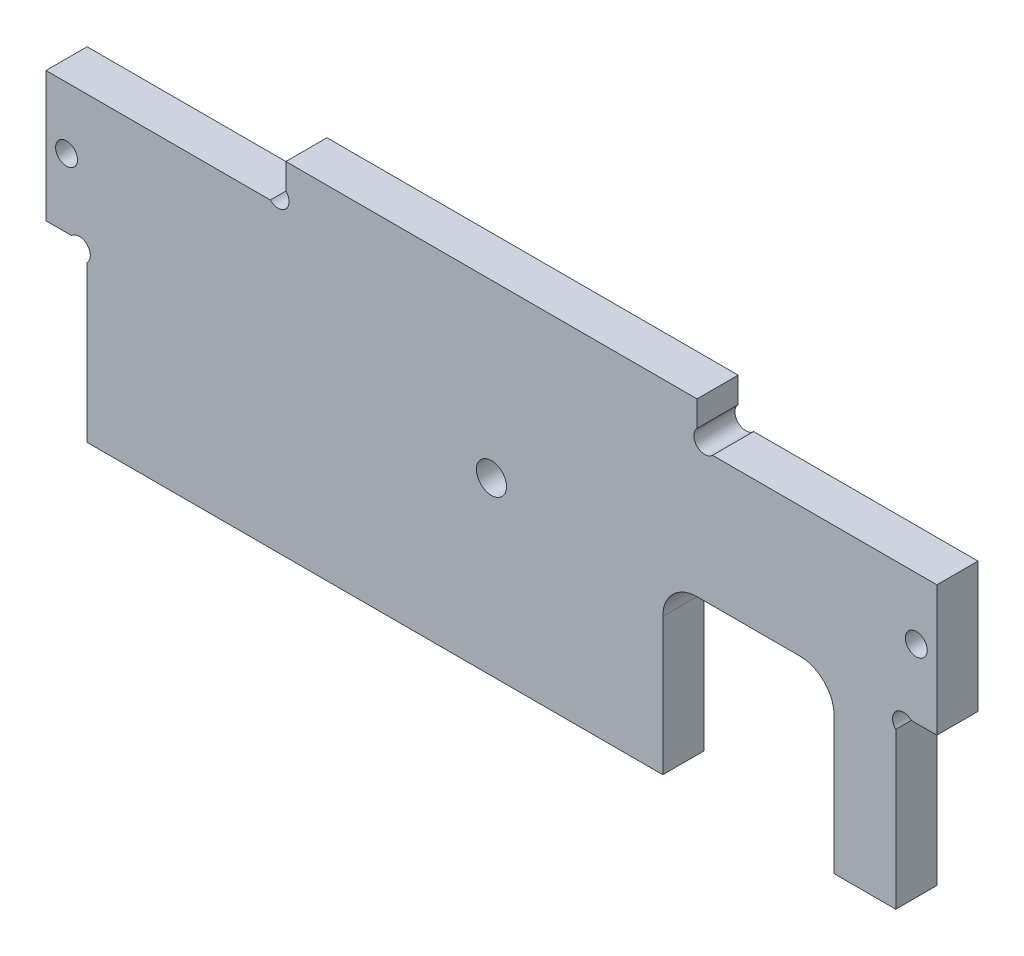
ISO-10303-21;
HEADER;
FILE_DESCRIPTION(('STEP AP214'),'2;1');
FILE_NAME('part.step','',(''),(''),'','','');
FILE_SCHEMA(('AUTOMOTIVE_DESIGN { 1 0 10303 214 1 1 1 1 }'));
ENDSEC;
DATA;
#1=APPLICATION_CONTEXT('core data for automotive mechanical design processes');
#2=APPLICATION_PROTOCOL_DEFINITION('international standard','automotive_design',2000,#1);
#3=PRODUCT_CONTEXT('',#1,'mechanical');
#4=PRODUCT('Part','Part','',(#3));
#5=PRODUCT_RELATED_PRODUCT_CATEGORY('part','',(#4));
#6=PRODUCT_DEFINITION_FORMATION('','',#4);
#7=PRODUCT_DEFINITION_CONTEXT('part definition',#1,'design');
#8=PRODUCT_DEFINITION('design','',#6,#7);
#9=PRODUCT_DEFINITION_SHAPE('','',#8);
#10=(LENGTH_UNIT() NAMED_UNIT(*) SI_UNIT(.MILLI.,.METRE.));
#11=(NAMED_UNIT(*) PLANE_ANGLE_UNIT() SI_UNIT($,.RADIAN.));
#12=(NAMED_UNIT(*) SI_UNIT($,.STERADIAN.) SOLID_ANGLE_UNIT());
#13=UNCERTAINTY_MEASURE_WITH_UNIT(LENGTH_MEASURE(1.E-05),#10,'distance_accuracy_value','');
#14=(GEOMETRIC_REPRESENTATION_CONTEXT(3) GLOBAL_UNCERTAINTY_ASSIGNED_CONTEXT((#13)) GLOBAL_UNIT_ASSIGNED_CONTEXT((#10,
#11,#12)) REPRESENTATION_CONTEXT('',''));
#15=CARTESIAN_POINT('',(0.,0.,0.));
#16=DIRECTION('',(0.,0.,1.));
#17=DIRECTION('',(1.,0.,0.));
#18=AXIS2_PLACEMENT_3D('',#15,#16,#17);
#19=CARTESIAN_POINT('',(31.1313708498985,45.1313708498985,6.));
#20=DIRECTION('',(0.,0.,1.));
#21=DIRECTION('',(1.,0.,0.));
#22=AXIS2_PLACEMENT_3D('',#19,#20,#21);
#23=PLANE('',#22);
#24=CARTESIAN_POINT('',(-62.,35.,6.));
#25=DIRECTION('',(0.,0.,1.));
#26=DIRECTION('',(-1.,0.,0.));
#27=AXIS2_PLACEMENT_3D('',#24,#25,#26);
#28=CIRCLE('',#27,1.6);
#29=CARTESIAN_POINT('',(-63.6,35.,6.));
#30=VERTEX_POINT('',#29);
#31=EDGE_CURVE('E421',#30,#30,#28,.T.);
#32=ORIENTED_EDGE('',*,*,#31,.F.);
#33=EDGE_LOOP('',(#32));
#34=FACE_BOUND('',#33,.T.);
#35=CARTESIAN_POINT('',(31.1313708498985,45.1313708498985,6.));
#36=DIRECTION('',(0.,0.,-1.));
#37=DIRECTION('',(1.,0.,0.));
#38=AXIS2_PLACEMENT_3D('',#35,#36,#37);
#39=CIRCLE('',#38,1.59999999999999);
#40=CARTESIAN_POINT('',(32.2627416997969,44.,6.));
#41=VERTEX_POINT('',#40);
#42=CARTESIAN_POINT('',(30.,46.2627416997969,6.));
#43=VERTEX_POINT('',#42);
#44=EDGE_CURVE('E261',#41,#43,#39,.T.);
#45=ORIENTED_EDGE('',*,*,#44,.T.);
#46=DIRECTION('',(0.,1.,0.));
#47=VECTOR('',#46,1.);
#48=CARTESIAN_POINT('',(30.,46.2627416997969,6.));
#49=LINE('',#48,#47);
#50=CARTESIAN_POINT('',(30.,50.,6.));
#51=VERTEX_POINT('',#50);
#52=EDGE_CURVE('E139',#43,#51,#49,.T.);
#53=ORIENTED_EDGE('',*,*,#52,.T.);
#54=DIRECTION('',(-1.,0.,0.));
#55=VECTOR('',#54,1.);
#56=CARTESIAN_POINT('',(-30.,50.,6.));
#57=LINE('',#56,#55);
#58=CARTESIAN_POINT('',(-30.,50.,6.));
#59=VERTEX_POINT('',#58);
#60=EDGE_CURVE('E318',#51,#59,#57,.T.);
#61=ORIENTED_EDGE('',*,*,#60,.T.);
#62=DIRECTION('',(0.,-1.,0.));
#63=VECTOR('',#62,1.);
#64=CARTESIAN_POINT('',(-30.,46.2627416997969,6.));
#65=LINE('',#64,#63);
#66=CARTESIAN_POINT('',(-30.,46.2627416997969,6.));
#67=VERTEX_POINT('',#66);
#68=EDGE_CURVE('E337',#59,#67,#65,.T.);
#69=ORIENTED_EDGE('',*,*,#68,.T.);
#70=CARTESIAN_POINT('',(-31.1313708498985,45.1313708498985,6.));
#71=DIRECTION('',(0.,0.,-1.));
#72=DIRECTION('',(-1.,0.,0.));
#73=AXIS2_PLACEMENT_3D('',#70,#71,#72);
#74=CIRCLE('',#73,1.59999999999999);
#75=CARTESIAN_POINT('',(-32.2627416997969,44.,6.));
#76=VERTEX_POINT('',#75);
#77=EDGE_CURVE('E334',#67,#76,#74,.T.);
#78=ORIENTED_EDGE('',*,*,#77,.T.);
#79=DIRECTION('',(-1.,0.,0.));
#80=VECTOR('',#79,1.);
#81=CARTESIAN_POINT('',(-32.2627416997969,44.,6.));
#82=LINE('',#81,#80);
#83=CARTESIAN_POINT('',(-65.,44.,6.));
#84=VERTEX_POINT('',#83);
#85=EDGE_CURVE('E336',#76,#84,#82,.T.);
#86=ORIENTED_EDGE('',*,*,#85,.T.);
#87=DIRECTION('',(0.,-1.,0.));
#88=VECTOR('',#87,1.);
#89=CARTESIAN_POINT('',(-65.,44.,6.));
#90=LINE('',#89,#88);
#91=CARTESIAN_POINT('',(-65.,25.,6.));
#92=VERTEX_POINT('',#91);
#93=EDGE_CURVE('E339',#84,#92,#90,.T.);
#94=ORIENTED_EDGE('',*,*,#93,.T.);
#95=DIRECTION('',(1.,0.,0.));
#96=VECTOR('',#95,1.);
#97=CARTESIAN_POINT('',(-65.,25.,6.));
#98=LINE('',#97,#96);
#99=CARTESIAN_POINT('',(-61.262741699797,25.,6.));
#100=VERTEX_POINT('',#99);
#101=EDGE_CURVE('E345',#92,#100,#98,.T.);
#102=ORIENTED_EDGE('',*,*,#101,.T.);
#103=CARTESIAN_POINT('',(-60.1313708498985,23.8686291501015,6.));
#104=DIRECTION('',(0.,0.,-1.));
#105=DIRECTION('',(-1.,0.,0.));
#106=AXIS2_PLACEMENT_3D('',#103,#104,#105);
#107=CIRCLE('',#106,1.60000000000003);
#108=CARTESIAN_POINT('',(-59.,22.737258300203,6.));
#109=VERTEX_POINT('',#108);
#110=EDGE_CURVE('E347',#100,#109,#107,.T.);
#111=ORIENTED_EDGE('',*,*,#110,.T.);
#112=DIRECTION('',(0.,-1.,0.));
#113=VECTOR('',#112,1.);
#114=CARTESIAN_POINT('',(-59.,22.737258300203,6.));
#115=LINE('',#114,#113);
#116=CARTESIAN_POINT('',(-59.,0.,6.));
#117=VERTEX_POINT('',#116);
#118=EDGE_CURVE('E349',#109,#117,#115,.T.);
#119=ORIENTED_EDGE('',*,*,#118,.T.);
#120=DIRECTION('',(1.,0.,0.));
#121=VECTOR('',#120,1.);
#122=CARTESIAN_POINT('',(-59.,0.,6.));
#123=LINE('',#122,#121);
#124=CARTESIAN_POINT('',(25.,0.,6.));
#125=VERTEX_POINT('',#124);
#126=EDGE_CURVE('E351',#117,#125,#123,.T.);
#127=ORIENTED_EDGE('',*,*,#126,.T.);
#128=DIRECTION('',(0.,1.,0.));
#129=VECTOR('',#128,1.);
#130=CARTESIAN_POINT('',(25.,0.,6.));
#131=LINE('',#130,#129);
#132=CARTESIAN_POINT('',(25.,20.,6.));
#133=VERTEX_POINT('',#132);
#134=EDGE_CURVE('E353',#125,#133,#131,.T.);
#135=ORIENTED_EDGE('',*,*,#134,.T.);
#136=CARTESIAN_POINT('',(30.,20.,6.));
#137=DIRECTION('',(0.,0.,-1.));
#138=DIRECTION('',(-1.,0.,0.));
#139=AXIS2_PLACEMENT_3D('',#136,#137,#138);
#140=CIRCLE('',#139,5.);
#141=CARTESIAN_POINT('',(30.,25.,6.));
#142=VERTEX_POINT('',#141);
#143=EDGE_CURVE('E355',#133,#142,#140,.T.);
#144=ORIENTED_EDGE('',*,*,#143,.T.);
#145=DIRECTION('',(1.,0.,0.));
#146=VECTOR('',#145,1.);
#147=CARTESIAN_POINT('',(30.,25.,6.));
#148=LINE('',#147,#146);
#149=CARTESIAN_POINT('',(45.,25.,6.));
#150=VERTEX_POINT('',#149);
#151=EDGE_CURVE('E357',#142,#150,#148,.T.);
#152=ORIENTED_EDGE('',*,*,#151,.T.);
#153=CARTESIAN_POINT('',(45.,20.,6.));
#154=DIRECTION('',(0.,0.,-1.));
#155=DIRECTION('',(-1.,0.,0.));
#156=AXIS2_PLACEMENT_3D('',#153,#154,#155);
#157=CIRCLE('',#156,5.);
#158=CARTESIAN_POINT('',(50.,20.,6.));
#159=VERTEX_POINT('',#158);
#160=EDGE_CURVE('E359',#150,#159,#157,.T.);
#161=ORIENTED_EDGE('',*,*,#160,.T.);
#162=DIRECTION('',(0.,-1.,0.));
#163=VECTOR('',#162,1.);
#164=CARTESIAN_POINT('',(50.,20.,6.));
#165=LINE('',#164,#163);
#166=CARTESIAN_POINT('',(50.,0.,6.));
#167=VERTEX_POINT('',#166);
#168=EDGE_CURVE('E361',#159,#167,#165,.T.);
#169=ORIENTED_EDGE('',*,*,#168,.T.);
#170=DIRECTION('',(1.,0.,0.));
#171=VECTOR('',#170,1.);
#172=CARTESIAN_POINT('',(50.,0.,6.));
#173=LINE('',#172,#171);
#174=CARTESIAN_POINT('',(59.,0.,6.));
#175=VERTEX_POINT('',#174);
#176=EDGE_CURVE('E363',#167,#175,#173,.T.);
#177=ORIENTED_EDGE('',*,*,#176,.T.);
#178=DIRECTION('',(0.,1.,0.));
#179=VECTOR('',#178,1.);
#180=CARTESIAN_POINT('',(59.,22.737258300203,6.));
#181=LINE('',#180,#179);
#182=CARTESIAN_POINT('',(59.,22.737258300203,6.));
#183=VERTEX_POINT('',#182);
#184=EDGE_CURVE('E365',#175,#183,#181,.T.);
#185=ORIENTED_EDGE('',*,*,#184,.T.);
#186=CARTESIAN_POINT('',(60.1313708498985,23.8686291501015,6.));
#187=DIRECTION('',(0.,0.,-1.));
#188=DIRECTION('',(1.,0.,0.));
#189=AXIS2_PLACEMENT_3D('',#186,#187,#188);
#190=CIRCLE('',#189,1.60000000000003);
#191=CARTESIAN_POINT('',(61.262741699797,25.,6.));
#192=VERTEX_POINT('',#191);
#193=EDGE_CURVE('E200',#183,#192,#190,.T.);
#194=ORIENTED_EDGE('',*,*,#193,.T.);
#195=DIRECTION('',(1.,0.,0.));
#196=VECTOR('',#195,1.);
#197=CARTESIAN_POINT('',(65.,25.,6.));
#198=LINE('',#197,#196);
#199=CARTESIAN_POINT('',(65.,25.,6.));
#200=VERTEX_POINT('',#199);
#201=EDGE_CURVE('E194',#192,#200,#198,.T.);
#202=ORIENTED_EDGE('',*,*,#201,.T.);
#203=DIRECTION('',(0.,1.,0.));
#204=VECTOR('',#203,1.);
#205=CARTESIAN_POINT('',(65.,44.,6.));
#206=LINE('',#205,#204);
#207=CARTESIAN_POINT('',(65.,44.,6.));
#208=VERTEX_POINT('',#207);
#209=EDGE_CURVE('E198',#200,#208,#206,.T.);
#210=ORIENTED_EDGE('',*,*,#209,.T.);
#211=DIRECTION('',(-1.,0.,0.));
#212=VECTOR('',#211,1.);
#213=CARTESIAN_POINT('',(32.2627416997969,44.,6.));
#214=LINE('',#213,#212);
#215=EDGE_CURVE('E54',#208,#41,#214,.T.);
#216=ORIENTED_EDGE('',*,*,#215,.T.);
#217=EDGE_LOOP('',(#45,#53,#61,#69,#78,#86,#94,#102,#111,#119,#127,#135,#144,#152,#161,#169,
#177,#185,#194,#202,#210,#216));
#218=FACE_BOUND('',#217,.T.);
#219=CARTESIAN_POINT('',(62.,35.,6.));
#220=DIRECTION('',(0.,0.,1.));
#221=DIRECTION('',(1.,0.,0.));
#222=AXIS2_PLACEMENT_3D('',#219,#220,#221);
#223=CIRCLE('',#222,1.60000000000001);
#224=CARTESIAN_POINT('',(63.6,35.,6.));
#225=VERTEX_POINT('',#224);
#226=EDGE_CURVE('E222',#225,#225,#223,.T.);
#227=ORIENTED_EDGE('',*,*,#226,.F.);
#228=EDGE_LOOP('',(#227));
#229=FACE_BOUND('',#228,.T.);
#230=CARTESIAN_POINT('',(0.,25.,6.));
#231=DIRECTION('',(0.,0.,1.));
#232=DIRECTION('',(1.,0.,0.));
#233=AXIS2_PLACEMENT_3D('',#230,#231,#232);
#234=CIRCLE('',#233,2.2);
#235=CARTESIAN_POINT('',(2.2,25.,6.));
#236=VERTEX_POINT('',#235);
#237=EDGE_CURVE('E412',#236,#236,#234,.T.);
#238=ORIENTED_EDGE('',*,*,#237,.F.);
#239=EDGE_LOOP('',(#238));
#240=FACE_BOUND('',#239,.T.);
#241=ADVANCED_FACE('F37',(#34,#218,#229,#240),#23,.T.);
#242=CARTESIAN_POINT('',(31.1313708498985,45.1313708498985,0.));
#243=DIRECTION('',(0.,0.,1.));
#244=DIRECTION('',(1.,0.,0.));
#245=AXIS2_PLACEMENT_3D('',#242,#243,#244);
#246=PLANE('',#245);
#247=CARTESIAN_POINT('',(-62.,35.,0.));
#248=DIRECTION('',(0.,0.,1.));
#249=DIRECTION('',(-1.,0.,0.));
#250=AXIS2_PLACEMENT_3D('',#247,#248,#249);
#251=CIRCLE('',#250,1.6);
#252=CARTESIAN_POINT('',(-63.6,35.,0.));
#253=VERTEX_POINT('',#252);
#254=EDGE_CURVE('E418',#253,#253,#251,.T.);
#255=ORIENTED_EDGE('',*,*,#254,.T.);
#256=EDGE_LOOP('',(#255));
#257=FACE_BOUND('',#256,.T.);
#258=CARTESIAN_POINT('',(31.1313708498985,45.1313708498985,0.));
#259=DIRECTION('',(0.,0.,-1.));
#260=DIRECTION('',(1.,0.,0.));
#261=AXIS2_PLACEMENT_3D('',#258,#259,#260);
#262=CIRCLE('',#261,1.59999999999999);
#263=CARTESIAN_POINT('',(32.2627416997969,44.,0.));
#264=VERTEX_POINT('',#263);
#265=CARTESIAN_POINT('',(30.,46.2627416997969,0.));
#266=VERTEX_POINT('',#265);
#267=EDGE_CURVE('E218',#264,#266,#262,.T.);
#268=ORIENTED_EDGE('',*,*,#267,.F.);
#269=DIRECTION('',(-1.,0.,0.));
#270=VECTOR('',#269,1.);
#271=CARTESIAN_POINT('',(32.2627416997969,44.,0.));
#272=LINE('',#271,#270);
#273=CARTESIAN_POINT('',(65.,44.,0.));
#274=VERTEX_POINT('',#273);
#275=EDGE_CURVE('E131',#274,#264,#272,.T.);
#276=ORIENTED_EDGE('',*,*,#275,.F.);
#277=DIRECTION('',(0.,1.,0.));
#278=VECTOR('',#277,1.);
#279=CARTESIAN_POINT('',(65.,44.,0.));
#280=LINE('',#279,#278);
#281=CARTESIAN_POINT('',(65.,25.,0.));
#282=VERTEX_POINT('',#281);
#283=EDGE_CURVE('E125',#282,#274,#280,.T.);
#284=ORIENTED_EDGE('',*,*,#283,.F.);
#285=DIRECTION('',(1.,0.,0.));
#286=VECTOR('',#285,1.);
#287=CARTESIAN_POINT('',(65.,25.,0.));
#288=LINE('',#287,#286);
#289=CARTESIAN_POINT('',(61.262741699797,25.,0.));
#290=VERTEX_POINT('',#289);
#291=EDGE_CURVE('E208',#290,#282,#288,.T.);
#292=ORIENTED_EDGE('',*,*,#291,.F.);
#293=CARTESIAN_POINT('',(60.1313708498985,23.8686291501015,0.));
#294=DIRECTION('',(0.,0.,-1.));
#295=DIRECTION('',(1.,0.,0.));
#296=AXIS2_PLACEMENT_3D('',#293,#294,#295);
#297=CIRCLE('',#296,1.60000000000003);
#298=CARTESIAN_POINT('',(59.,22.737258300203,0.));
#299=VERTEX_POINT('',#298);
#300=EDGE_CURVE('E256',#299,#290,#297,.T.);
#301=ORIENTED_EDGE('',*,*,#300,.F.);
#302=DIRECTION('',(0.,1.,0.));
#303=VECTOR('',#302,1.);
#304=CARTESIAN_POINT('',(59.,22.737258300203,0.));
#305=LINE('',#304,#303);
#306=CARTESIAN_POINT('',(59.,0.,0.));
#307=VERTEX_POINT('',#306);
#308=EDGE_CURVE('E254',#307,#299,#305,.T.);
#309=ORIENTED_EDGE('',*,*,#308,.F.);
#310=DIRECTION('',(1.,0.,0.));
#311=VECTOR('',#310,1.);
#312=CARTESIAN_POINT('',(50.,0.,0.));
#313=LINE('',#312,#311);
#314=CARTESIAN_POINT('',(50.,0.,0.));
#315=VERTEX_POINT('',#314);
#316=EDGE_CURVE('E252',#315,#307,#313,.T.);
#317=ORIENTED_EDGE('',*,*,#316,.F.);
#318=DIRECTION('',(0.,-1.,0.));
#319=VECTOR('',#318,1.);
#320=CARTESIAN_POINT('',(50.,20.,0.));
#321=LINE('',#320,#319);
#322=CARTESIAN_POINT('',(50.,20.,0.));
#323=VERTEX_POINT('',#322);
#324=EDGE_CURVE('E250',#323,#315,#321,.T.);
#325=ORIENTED_EDGE('',*,*,#324,.F.);
#326=CARTESIAN_POINT('',(45.,20.,0.));
#327=DIRECTION('',(0.,0.,-1.));
#328=DIRECTION('',(-1.,0.,0.));
#329=AXIS2_PLACEMENT_3D('',#326,#327,#328);
#330=CIRCLE('',#329,5.);
#331=CARTESIAN_POINT('',(45.,25.,0.));
#332=VERTEX_POINT('',#331);
#333=EDGE_CURVE('E248',#332,#323,#330,.T.);
#334=ORIENTED_EDGE('',*,*,#333,.F.);
#335=DIRECTION('',(1.,0.,0.));
#336=VECTOR('',#335,1.);
#337=CARTESIAN_POINT('',(30.,25.,0.));
#338=LINE('',#337,#336);
#339=CARTESIAN_POINT('',(30.,25.,0.));
#340=VERTEX_POINT('',#339);
#341=EDGE_CURVE('E246',#340,#332,#338,.T.);
#342=ORIENTED_EDGE('',*,*,#341,.F.);
#343=CARTESIAN_POINT('',(30.,20.,0.));
#344=DIRECTION('',(0.,0.,-1.));
#345=DIRECTION('',(-1.,0.,0.));
#346=AXIS2_PLACEMENT_3D('',#343,#344,#345);
#347=CIRCLE('',#346,5.);
#348=CARTESIAN_POINT('',(25.,20.,0.));
#349=VERTEX_POINT('',#348);
#350=EDGE_CURVE('E244',#349,#340,#347,.T.);
#351=ORIENTED_EDGE('',*,*,#350,.F.);
#352=DIRECTION('',(0.,1.,0.));
#353=VECTOR('',#352,1.);
#354=CARTESIAN_POINT('',(25.,0.,0.));
#355=LINE('',#354,#353);
#356=CARTESIAN_POINT('',(25.,0.,0.));
#357=VERTEX_POINT('',#356);
#358=EDGE_CURVE('E242',#357,#349,#355,.T.);
#359=ORIENTED_EDGE('',*,*,#358,.F.);
#360=DIRECTION('',(1.,0.,0.));
#361=VECTOR('',#360,1.);
#362=CARTESIAN_POINT('',(-59.,0.,0.));
#363=LINE('',#362,#361);
#364=CARTESIAN_POINT('',(-59.,0.,0.));
#365=VERTEX_POINT('',#364);
#366=EDGE_CURVE('E240',#365,#357,#363,.T.);
#367=ORIENTED_EDGE('',*,*,#366,.F.);
#368=DIRECTION('',(0.,-1.,0.));
#369=VECTOR('',#368,1.);
#370=CARTESIAN_POINT('',(-59.,22.737258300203,0.));
#371=LINE('',#370,#369);
#372=CARTESIAN_POINT('',(-59.,22.737258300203,0.));
#373=VERTEX_POINT('',#372);
#374=EDGE_CURVE('E238',#373,#365,#371,.T.);
#375=ORIENTED_EDGE('',*,*,#374,.F.);
#376=CARTESIAN_POINT('',(-60.1313708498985,23.8686291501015,0.));
#377=DIRECTION('',(0.,0.,-1.));
#378=DIRECTION('',(-1.,0.,0.));
#379=AXIS2_PLACEMENT_3D('',#376,#377,#378);
#380=CIRCLE('',#379,1.60000000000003);
#381=CARTESIAN_POINT('',(-61.262741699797,25.,0.));
#382=VERTEX_POINT('',#381);
#383=EDGE_CURVE('E236',#382,#373,#380,.T.);
#384=ORIENTED_EDGE('',*,*,#383,.F.);
#385=DIRECTION('',(1.,0.,0.));
#386=VECTOR('',#385,1.);
#387=CARTESIAN_POINT('',(-65.,25.,0.));
#388=LINE('',#387,#386);
#389=CARTESIAN_POINT('',(-65.,25.,0.));
#390=VERTEX_POINT('',#389);
#391=EDGE_CURVE('E234',#390,#382,#388,.T.);
#392=ORIENTED_EDGE('',*,*,#391,.F.);
#393=DIRECTION('',(0.,-1.,0.));
#394=VECTOR('',#393,1.);
#395=CARTESIAN_POINT('',(-65.,44.,0.));
#396=LINE('',#395,#394);
#397=CARTESIAN_POINT('',(-65.,44.,0.));
#398=VERTEX_POINT('',#397);
#399=EDGE_CURVE('E232',#398,#390,#396,.T.);
#400=ORIENTED_EDGE('',*,*,#399,.F.);
#401=DIRECTION('',(-1.,0.,0.));
#402=VECTOR('',#401,1.);
#403=CARTESIAN_POINT('',(-32.2627416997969,44.,0.));
#404=LINE('',#403,#402);
#405=CARTESIAN_POINT('',(-32.2627416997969,44.,0.));
#406=VERTEX_POINT('',#405);
#407=EDGE_CURVE('E230',#406,#398,#404,.T.);
#408=ORIENTED_EDGE('',*,*,#407,.F.);
#409=CARTESIAN_POINT('',(-31.1313708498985,45.1313708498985,0.));
#410=DIRECTION('',(0.,0.,-1.));
#411=DIRECTION('',(-1.,0.,0.));
#412=AXIS2_PLACEMENT_3D('',#409,#410,#411);
#413=CIRCLE('',#412,1.59999999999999);
#414=CARTESIAN_POINT('',(-30.,46.2627416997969,0.));
#415=VERTEX_POINT('',#414);
#416=EDGE_CURVE('E228',#415,#406,#413,.T.);
#417=ORIENTED_EDGE('',*,*,#416,.F.);
#418=DIRECTION('',(0.,-1.,0.));
#419=VECTOR('',#418,1.);
#420=CARTESIAN_POINT('',(-30.,46.2627416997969,0.));
#421=LINE('',#420,#419);
#422=CARTESIAN_POINT('',(-30.,50.,0.));
#423=VERTEX_POINT('',#422);
#424=EDGE_CURVE('E226',#423,#415,#421,.T.);
#425=ORIENTED_EDGE('',*,*,#424,.F.);
#426=DIRECTION('',(-1.,0.,0.));
#427=VECTOR('',#426,1.);
#428=CARTESIAN_POINT('',(-30.,50.,0.));
#429=LINE('',#428,#427);
#430=CARTESIAN_POINT('',(30.,50.,0.));
#431=VERTEX_POINT('',#430);
#432=EDGE_CURVE('E224',#431,#423,#429,.T.);
#433=ORIENTED_EDGE('',*,*,#432,.F.);
#434=DIRECTION('',(0.,1.,0.));
#435=VECTOR('',#434,1.);
#436=CARTESIAN_POINT('',(30.,46.2627416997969,0.));
#437=LINE('',#436,#435);
#438=EDGE_CURVE('E221',#266,#431,#437,.T.);
#439=ORIENTED_EDGE('',*,*,#438,.F.);
#440=EDGE_LOOP('',(#268,#276,#284,#292,#301,#309,#317,#325,#334,#342,#351,#359,#367,#375,#384,
#392,#400,#408,#417,#425,#433,#439));
#441=FACE_BOUND('',#440,.T.);
#442=CARTESIAN_POINT('',(62.,35.,0.));
#443=DIRECTION('',(0.,0.,1.));
#444=DIRECTION('',(1.,0.,0.));
#445=AXIS2_PLACEMENT_3D('',#442,#443,#444);
#446=CIRCLE('',#445,1.60000000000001);
#447=CARTESIAN_POINT('',(63.6,35.,0.));
#448=VERTEX_POINT('',#447);
#449=EDGE_CURVE('E424',#448,#448,#446,.T.);
#450=ORIENTED_EDGE('',*,*,#449,.T.);
#451=EDGE_LOOP('',(#450));
#452=FACE_BOUND('',#451,.T.);
#453=CARTESIAN_POINT('',(0.,25.,0.));
#454=DIRECTION('',(0.,0.,1.));
#455=DIRECTION('',(1.,0.,0.));
#456=AXIS2_PLACEMENT_3D('',#453,#454,#455);
#457=CIRCLE('',#456,2.2);
#458=CARTESIAN_POINT('',(2.2,25.,0.));
#459=VERTEX_POINT('',#458);
#460=EDGE_CURVE('E415',#459,#459,#457,.T.);
#461=ORIENTED_EDGE('',*,*,#460,.T.);
#462=EDGE_LOOP('',(#461));
#463=FACE_BOUND('',#462,.T.);
#464=ADVANCED_FACE('F322',(#257,#441,#452,#463),#246,.F.);
#465=CARTESIAN_POINT('',(31.1313708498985,45.1313708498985,6.));
#466=DIRECTION('',(0.,0.,-1.));
#467=DIRECTION('',(-1.,0.,0.));
#468=AXIS2_PLACEMENT_3D('',#465,#466,#467);
#469=CYLINDRICAL_SURFACE('',#468,1.59999999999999);
#470=ORIENTED_EDGE('',*,*,#267,.T.);
#471=DIRECTION('',(0.,0.,-1.));
#472=VECTOR('',#471,1.);
#473=CARTESIAN_POINT('',(30.,46.2627416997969,6.));
#474=LINE('',#473,#472);
#475=EDGE_CURVE('E11',#43,#266,#474,.T.);
#476=ORIENTED_EDGE('',*,*,#475,.F.);
#477=ORIENTED_EDGE('',*,*,#44,.F.);
#478=DIRECTION('',(0.,0.,-1.));
#479=VECTOR('',#478,1.);
#480=CARTESIAN_POINT('',(32.2627416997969,44.,6.));
#481=LINE('',#480,#479);
#482=EDGE_CURVE('E214',#41,#264,#481,.T.);
#483=ORIENTED_EDGE('',*,*,#482,.T.);
#484=EDGE_LOOP('',(#470,#476,#477,#483));
#485=FACE_BOUND('',#484,.T.);
#486=ADVANCED_FACE('F39',(#485),#469,.F.);
#487=CARTESIAN_POINT('',(30.,46.2627416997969,6.));
#488=DIRECTION('',(-1.,0.,0.));
#489=DIRECTION('',(0.,-1.,0.));
#490=AXIS2_PLACEMENT_3D('',#487,#488,#489);
#491=PLANE('',#490);
#492=ORIENTED_EDGE('',*,*,#438,.T.);
#493=DIRECTION('',(0.,0.,-1.));
#494=VECTOR('',#493,1.);
#495=CARTESIAN_POINT('',(30.,50.,6.));
#496=LINE('',#495,#494);
#497=EDGE_CURVE('E46',#51,#431,#496,.T.);
#498=ORIENTED_EDGE('',*,*,#497,.F.);
#499=ORIENTED_EDGE('',*,*,#52,.F.);
#500=ORIENTED_EDGE('',*,*,#475,.T.);
#501=EDGE_LOOP('',(#492,#498,#499,#500));
#502=FACE_BOUND('',#501,.T.);
#503=ADVANCED_FACE('F625',(#502),#491,.F.);
#504=CARTESIAN_POINT('',(-30.,50.,6.));
#505=DIRECTION('',(0.,-1.,0.));
#506=DIRECTION('',(0.,0.,-1.));
#507=AXIS2_PLACEMENT_3D('',#504,#505,#506);
#508=PLANE('',#507);
#509=ORIENTED_EDGE('',*,*,#432,.T.);
#510=DIRECTION('',(0.,0.,-1.));
#511=VECTOR('',#510,1.);
#512=CARTESIAN_POINT('',(-30.,50.,6.));
#513=LINE('',#512,#511);
#514=EDGE_CURVE('E310',#59,#423,#513,.T.);
#515=ORIENTED_EDGE('',*,*,#514,.F.);
#516=ORIENTED_EDGE('',*,*,#60,.F.);
#517=ORIENTED_EDGE('',*,*,#497,.T.);
#518=EDGE_LOOP('',(#509,#515,#516,#517));
#519=FACE_BOUND('',#518,.T.);
#520=ADVANCED_FACE('F316',(#519),#508,.F.);
#521=CARTESIAN_POINT('',(-30.,46.2627416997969,6.));
#522=DIRECTION('',(1.,0.,0.));
#523=DIRECTION('',(0.,1.,0.));
#524=AXIS2_PLACEMENT_3D('',#521,#522,#523);
#525=PLANE('',#524);
#526=ORIENTED_EDGE('',*,*,#424,.T.);
#527=DIRECTION('',(0.,0.,-1.));
#528=VECTOR('',#527,1.);
#529=CARTESIAN_POINT('',(-30.,46.2627416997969,6.));
#530=LINE('',#529,#528);
#531=EDGE_CURVE('E307',#67,#415,#530,.T.);
#532=ORIENTED_EDGE('',*,*,#531,.F.);
#533=ORIENTED_EDGE('',*,*,#68,.F.);
#534=ORIENTED_EDGE('',*,*,#514,.T.);
#535=EDGE_LOOP('',(#526,#532,#533,#534));
#536=FACE_BOUND('',#535,.T.);
#537=ADVANCED_FACE('F328',(#536),#525,.F.);
#538=CARTESIAN_POINT('',(-31.1313708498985,45.1313708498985,6.));
#539=DIRECTION('',(0.,0.,-1.));
#540=DIRECTION('',(-1.,0.,0.));
#541=AXIS2_PLACEMENT_3D('',#538,#539,#540);
#542=CYLINDRICAL_SURFACE('',#541,1.59999999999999);
#543=ORIENTED_EDGE('',*,*,#416,.T.);
#544=DIRECTION('',(0.,0.,-1.));
#545=VECTOR('',#544,1.);
#546=CARTESIAN_POINT('',(-32.2627416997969,44.,6.));
#547=LINE('',#546,#545);
#548=EDGE_CURVE('E304',#76,#406,#547,.T.);
#549=ORIENTED_EDGE('',*,*,#548,.F.);
#550=ORIENTED_EDGE('',*,*,#77,.F.);
#551=ORIENTED_EDGE('',*,*,#531,.T.);
#552=EDGE_LOOP('',(#543,#549,#550,#551));
#553=FACE_BOUND('',#552,.T.);
#554=ADVANCED_FACE('F332',(#553),#542,.F.);
#555=CARTESIAN_POINT('',(-32.2627416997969,44.,6.));
#556=DIRECTION('',(0.,-1.,0.));
#557=DIRECTION('',(1.,0.,0.));
#558=AXIS2_PLACEMENT_3D('',#555,#556,#557);
#559=PLANE('',#558);
#560=ORIENTED_EDGE('',*,*,#407,.T.);
#561=DIRECTION('',(0.,0.,-1.));
#562=VECTOR('',#561,1.);
#563=CARTESIAN_POINT('',(-65.,44.,6.));
#564=LINE('',#563,#562);
#565=EDGE_CURVE('E301',#84,#398,#564,.T.);
#566=ORIENTED_EDGE('',*,*,#565,.F.);
#567=ORIENTED_EDGE('',*,*,#85,.F.);
#568=ORIENTED_EDGE('',*,*,#548,.T.);
#569=EDGE_LOOP('',(#560,#566,#567,#568));
#570=FACE_BOUND('',#569,.T.);
#571=ADVANCED_FACE('F590',(#570),#559,.F.);
#572=CARTESIAN_POINT('',(-65.,44.,6.));
#573=DIRECTION('',(1.,0.,0.));
#574=DIRECTION('',(0.,0.,-1.));
#575=AXIS2_PLACEMENT_3D('',#572,#573,#574);
#576=PLANE('',#575);
#577=ORIENTED_EDGE('',*,*,#399,.T.);
#578=DIRECTION('',(0.,0.,-1.));
#579=VECTOR('',#578,1.);
#580=CARTESIAN_POINT('',(-65.,25.,6.));
#581=LINE('',#580,#579);
#582=EDGE_CURVE('E298',#92,#390,#581,.T.);
#583=ORIENTED_EDGE('',*,*,#582,.F.);
#584=ORIENTED_EDGE('',*,*,#93,.F.);
#585=ORIENTED_EDGE('',*,*,#565,.T.);
#586=EDGE_LOOP('',(#577,#583,#584,#585));
#587=FACE_BOUND('',#586,.T.);
#588=ADVANCED_FACE('F580',(#587),#576,.F.);
#589=CARTESIAN_POINT('',(-65.,25.,6.));
#590=DIRECTION('',(0.,1.,0.));
#591=DIRECTION('',(-1.,0.,0.));
#592=AXIS2_PLACEMENT_3D('',#589,#590,#591);
#593=PLANE('',#592);
#594=ORIENTED_EDGE('',*,*,#391,.T.);
#595=DIRECTION('',(0.,0.,-1.));
#596=VECTOR('',#595,1.);
#597=CARTESIAN_POINT('',(-61.262741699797,25.,6.));
#598=LINE('',#597,#596);
#599=EDGE_CURVE('E295',#100,#382,#598,.T.);
#600=ORIENTED_EDGE('',*,*,#599,.F.);
#601=ORIENTED_EDGE('',*,*,#101,.F.);
#602=ORIENTED_EDGE('',*,*,#582,.T.);
#603=EDGE_LOOP('',(#594,#600,#601,#602));
#604=FACE_BOUND('',#603,.T.);
#605=ADVANCED_FACE('F570',(#604),#593,.F.);
#606=CARTESIAN_POINT('',(-60.1313708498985,23.8686291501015,6.));
#607=DIRECTION('',(0.,0.,-1.));
#608=DIRECTION('',(-1.,0.,0.));
#609=AXIS2_PLACEMENT_3D('',#606,#607,#608);
#610=CYLINDRICAL_SURFACE('',#609,1.60000000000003);
#611=ORIENTED_EDGE('',*,*,#383,.T.);
#612=DIRECTION('',(0.,0.,-1.));
#613=VECTOR('',#612,1.);
#614=CARTESIAN_POINT('',(-59.,22.737258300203,6.));
#615=LINE('',#614,#613);
#616=EDGE_CURVE('E292',#109,#373,#615,.T.);
#617=ORIENTED_EDGE('',*,*,#616,.F.);
#618=ORIENTED_EDGE('',*,*,#110,.F.);
#619=ORIENTED_EDGE('',*,*,#599,.T.);
#620=EDGE_LOOP('',(#611,#617,#618,#619));
#621=FACE_BOUND('',#620,.T.);
#622=ADVANCED_FACE('F560',(#621),#610,.F.);
#623=CARTESIAN_POINT('',(-59.,22.737258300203,6.));
#624=DIRECTION('',(1.,0.,0.));
#625=DIRECTION('',(0.,0.,-1.));
#626=AXIS2_PLACEMENT_3D('',#623,#624,#625);
#627=PLANE('',#626);
#628=ORIENTED_EDGE('',*,*,#374,.T.);
#629=DIRECTION('',(0.,0.,-1.));
#630=VECTOR('',#629,1.);
#631=CARTESIAN_POINT('',(-59.,0.,6.));
#632=LINE('',#631,#630);
#633=EDGE_CURVE('E289',#117,#365,#632,.T.);
#634=ORIENTED_EDGE('',*,*,#633,.F.);
#635=ORIENTED_EDGE('',*,*,#118,.F.);
#636=ORIENTED_EDGE('',*,*,#616,.T.);
#637=EDGE_LOOP('',(#628,#634,#635,#636));
#638=FACE_BOUND('',#637,.T.);
#639=ADVANCED_FACE('F550',(#638),#627,.F.);
#640=CARTESIAN_POINT('',(-59.,0.,6.));
#641=DIRECTION('',(0.,1.,0.));
#642=DIRECTION('',(0.,0.,1.));
#643=AXIS2_PLACEMENT_3D('',#640,#641,#642);
#644=PLANE('',#643);
#645=ORIENTED_EDGE('',*,*,#366,.T.);
#646=DIRECTION('',(0.,0.,-1.));
#647=VECTOR('',#646,1.);
#648=CARTESIAN_POINT('',(25.,0.,6.));
#649=LINE('',#648,#647);
#650=EDGE_CURVE('E286',#125,#357,#649,.T.);
#651=ORIENTED_EDGE('',*,*,#650,.F.);
#652=ORIENTED_EDGE('',*,*,#126,.F.);
#653=ORIENTED_EDGE('',*,*,#633,.T.);
#654=EDGE_LOOP('',(#645,#651,#652,#653));
#655=FACE_BOUND('',#654,.T.);
#656=ADVANCED_FACE('F540',(#655),#644,.F.);
#657=CARTESIAN_POINT('',(25.,0.,6.));
#658=DIRECTION('',(-1.,0.,0.));
#659=DIRECTION('',(0.,-1.,0.));
#660=AXIS2_PLACEMENT_3D('',#657,#658,#659);
#661=PLANE('',#660);
#662=ORIENTED_EDGE('',*,*,#358,.T.);
#663=DIRECTION('',(0.,0.,-1.));
#664=VECTOR('',#663,1.);
#665=CARTESIAN_POINT('',(25.,20.,6.));
#666=LINE('',#665,#664);
#667=EDGE_CURVE('E283',#133,#349,#666,.T.);
#668=ORIENTED_EDGE('',*,*,#667,.F.);
#669=ORIENTED_EDGE('',*,*,#134,.F.);
#670=ORIENTED_EDGE('',*,*,#650,.T.);
#671=EDGE_LOOP('',(#662,#668,#669,#670));
#672=FACE_BOUND('',#671,.T.);
#673=ADVANCED_FACE('F530',(#672),#661,.F.);
#674=CARTESIAN_POINT('',(30.,20.,6.));
#675=DIRECTION('',(0.,0.,-1.));
#676=DIRECTION('',(-1.,0.,0.));
#677=AXIS2_PLACEMENT_3D('',#674,#675,#676);
#678=CYLINDRICAL_SURFACE('',#677,5.);
#679=ORIENTED_EDGE('',*,*,#350,.T.);
#680=DIRECTION('',(0.,0.,-1.));
#681=VECTOR('',#680,1.);
#682=CARTESIAN_POINT('',(30.,25.,6.));
#683=LINE('',#682,#681);
#684=EDGE_CURVE('E280',#142,#340,#683,.T.);
#685=ORIENTED_EDGE('',*,*,#684,.F.);
#686=ORIENTED_EDGE('',*,*,#143,.F.);
#687=ORIENTED_EDGE('',*,*,#667,.T.);
#688=EDGE_LOOP('',(#679,#685,#686,#687));
#689=FACE_BOUND('',#688,.T.);
#690=ADVANCED_FACE('F520',(#689),#678,.F.);
#691=CARTESIAN_POINT('',(30.,25.,6.));
#692=DIRECTION('',(0.,1.,0.));
#693=DIRECTION('',(0.,0.,1.));
#694=AXIS2_PLACEMENT_3D('',#691,#692,#693);
#695=PLANE('',#694);
#696=ORIENTED_EDGE('',*,*,#341,.T.);
#697=DIRECTION('',(0.,0.,-1.));
#698=VECTOR('',#697,1.);
#699=CARTESIAN_POINT('',(45.,25.,6.));
#700=LINE('',#699,#698);
#701=EDGE_CURVE('E277',#150,#332,#700,.T.);
#702=ORIENTED_EDGE('',*,*,#701,.F.);
#703=ORIENTED_EDGE('',*,*,#151,.F.);
#704=ORIENTED_EDGE('',*,*,#684,.T.);
#705=EDGE_LOOP('',(#696,#702,#703,#704));
#706=FACE_BOUND('',#705,.T.);
#707=ADVANCED_FACE('F510',(#706),#695,.F.);
#708=CARTESIAN_POINT('',(45.,20.,6.));
#709=DIRECTION('',(0.,0.,-1.));
#710=DIRECTION('',(-1.,0.,0.));
#711=AXIS2_PLACEMENT_3D('',#708,#709,#710);
#712=CYLINDRICAL_SURFACE('',#711,5.);
#713=ORIENTED_EDGE('',*,*,#333,.T.);
#714=DIRECTION('',(0.,0.,-1.));
#715=VECTOR('',#714,1.);
#716=CARTESIAN_POINT('',(50.,20.,6.));
#717=LINE('',#716,#715);
#718=EDGE_CURVE('E274',#159,#323,#717,.T.);
#719=ORIENTED_EDGE('',*,*,#718,.F.);
#720=ORIENTED_EDGE('',*,*,#160,.F.);
#721=ORIENTED_EDGE('',*,*,#701,.T.);
#722=EDGE_LOOP('',(#713,#719,#720,#721));
#723=FACE_BOUND('',#722,.T.);
#724=ADVANCED_FACE('F500',(#723),#712,.F.);
#725=CARTESIAN_POINT('',(50.,20.,6.));
#726=DIRECTION('',(1.,0.,0.));
#727=DIRECTION('',(0.,0.,-1.));
#728=AXIS2_PLACEMENT_3D('',#725,#726,#727);
#729=PLANE('',#728);
#730=ORIENTED_EDGE('',*,*,#324,.T.);
#731=DIRECTION('',(0.,0.,-1.));
#732=VECTOR('',#731,1.);
#733=CARTESIAN_POINT('',(50.,0.,6.));
#734=LINE('',#733,#732);
#735=EDGE_CURVE('E271',#167,#315,#734,.T.);
#736=ORIENTED_EDGE('',*,*,#735,.F.);
#737=ORIENTED_EDGE('',*,*,#168,.F.);
#738=ORIENTED_EDGE('',*,*,#718,.T.);
#739=EDGE_LOOP('',(#730,#736,#737,#738));
#740=FACE_BOUND('',#739,.T.);
#741=ADVANCED_FACE('F490',(#740),#729,.F.);
#742=CARTESIAN_POINT('',(50.,0.,6.));
#743=DIRECTION('',(0.,1.,0.));
#744=DIRECTION('',(0.,0.,1.));
#745=AXIS2_PLACEMENT_3D('',#742,#743,#744);
#746=PLANE('',#745);
#747=ORIENTED_EDGE('',*,*,#316,.T.);
#748=DIRECTION('',(0.,0.,-1.));
#749=VECTOR('',#748,1.);
#750=CARTESIAN_POINT('',(59.,0.,6.));
#751=LINE('',#750,#749);
#752=EDGE_CURVE('E268',#175,#307,#751,.T.);
#753=ORIENTED_EDGE('',*,*,#752,.F.);
#754=ORIENTED_EDGE('',*,*,#176,.F.);
#755=ORIENTED_EDGE('',*,*,#735,.T.);
#756=EDGE_LOOP('',(#747,#753,#754,#755));
#757=FACE_BOUND('',#756,.T.);
#758=ADVANCED_FACE('F481',(#757),#746,.F.);
#759=CARTESIAN_POINT('',(59.,22.737258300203,6.));
#760=DIRECTION('',(-1.,0.,0.));
#761=DIRECTION('',(0.,0.,1.));
#762=AXIS2_PLACEMENT_3D('',#759,#760,#761);
#763=PLANE('',#762);
#764=ORIENTED_EDGE('',*,*,#308,.T.);
#765=DIRECTION('',(0.,0.,-1.));
#766=VECTOR('',#765,1.);
#767=CARTESIAN_POINT('',(59.,22.737258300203,6.));
#768=LINE('',#767,#766);
#769=EDGE_CURVE('E265',#183,#299,#768,.T.);
#770=ORIENTED_EDGE('',*,*,#769,.F.);
#771=ORIENTED_EDGE('',*,*,#184,.F.);
#772=ORIENTED_EDGE('',*,*,#752,.T.);
#773=EDGE_LOOP('',(#764,#770,#771,#772));
#774=FACE_BOUND('',#773,.T.);
#775=ADVANCED_FACE('F371',(#774),#763,.F.);
#776=CARTESIAN_POINT('',(60.1313708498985,23.8686291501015,6.));
#777=DIRECTION('',(0.,0.,-1.));
#778=DIRECTION('',(-1.,0.,0.));
#779=AXIS2_PLACEMENT_3D('',#776,#777,#778);
#780=CYLINDRICAL_SURFACE('',#779,1.60000000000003);
#781=ORIENTED_EDGE('',*,*,#300,.T.);
#782=DIRECTION('',(0.,0.,-1.));
#783=VECTOR('',#782,1.);
#784=CARTESIAN_POINT('',(61.262741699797,25.,6.));
#785=LINE('',#784,#783);
#786=EDGE_CURVE('E209',#192,#290,#785,.T.);
#787=ORIENTED_EDGE('',*,*,#786,.F.);
#788=ORIENTED_EDGE('',*,*,#193,.F.);
#789=ORIENTED_EDGE('',*,*,#769,.T.);
#790=EDGE_LOOP('',(#781,#787,#788,#789));
#791=FACE_BOUND('',#790,.T.);
#792=ADVANCED_FACE('F375',(#791),#780,.F.);
#793=CARTESIAN_POINT('',(65.,25.,6.));
#794=DIRECTION('',(0.,1.,0.));
#795=DIRECTION('',(-1.,0.,0.));
#796=AXIS2_PLACEMENT_3D('',#793,#794,#795);
#797=PLANE('',#796);
#798=ORIENTED_EDGE('',*,*,#291,.T.);
#799=DIRECTION('',(0.,0.,-1.));
#800=VECTOR('',#799,1.);
#801=CARTESIAN_POINT('',(65.,25.,6.));
#802=LINE('',#801,#800);
#803=EDGE_CURVE('E205',#200,#282,#802,.T.);
#804=ORIENTED_EDGE('',*,*,#803,.F.);
#805=ORIENTED_EDGE('',*,*,#201,.F.);
#806=ORIENTED_EDGE('',*,*,#786,.T.);
#807=EDGE_LOOP('',(#798,#804,#805,#806));
#808=FACE_BOUND('',#807,.T.);
#809=ADVANCED_FACE('F206',(#808),#797,.F.);
#810=CARTESIAN_POINT('',(65.,44.,6.));
#811=DIRECTION('',(-1.,0.,0.));
#812=DIRECTION('',(0.,0.,1.));
#813=AXIS2_PLACEMENT_3D('',#810,#811,#812);
#814=PLANE('',#813);
#815=ORIENTED_EDGE('',*,*,#283,.T.);
#816=DIRECTION('',(0.,0.,-1.));
#817=VECTOR('',#816,1.);
#818=CARTESIAN_POINT('',(65.,44.,6.));
#819=LINE('',#818,#817);
#820=EDGE_CURVE('E210',#208,#274,#819,.T.);
#821=ORIENTED_EDGE('',*,*,#820,.F.);
#822=ORIENTED_EDGE('',*,*,#209,.F.);
#823=ORIENTED_EDGE('',*,*,#803,.T.);
#824=EDGE_LOOP('',(#815,#821,#822,#823));
#825=FACE_BOUND('',#824,.T.);
#826=ADVANCED_FACE('F212',(#825),#814,.F.);
#827=CARTESIAN_POINT('',(32.2627416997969,44.,6.));
#828=DIRECTION('',(0.,-1.,0.));
#829=DIRECTION('',(1.,0.,0.));
#830=AXIS2_PLACEMENT_3D('',#827,#828,#829);
#831=PLANE('',#830);
#832=ORIENTED_EDGE('',*,*,#275,.T.);
#833=ORIENTED_EDGE('',*,*,#482,.F.);
#834=ORIENTED_EDGE('',*,*,#215,.F.);
#835=ORIENTED_EDGE('',*,*,#820,.T.);
#836=EDGE_LOOP('',(#832,#833,#834,#835));
#837=FACE_BOUND('',#836,.T.);
#838=ADVANCED_FACE('F379',(#837),#831,.F.);
#839=CARTESIAN_POINT('',(62.,35.,6.));
#840=DIRECTION('',(0.,0.,-1.));
#841=DIRECTION('',(-1.,0.,0.));
#842=AXIS2_PLACEMENT_3D('',#839,#840,#841);
#843=CYLINDRICAL_SURFACE('',#842,1.60000000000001);
#844=ORIENTED_EDGE('',*,*,#226,.T.);
#845=EDGE_LOOP('',(#844));
#846=FACE_BOUND('',#845,.T.);
#847=ORIENTED_EDGE('',*,*,#449,.F.);
#848=EDGE_LOOP('',(#847));
#849=FACE_BOUND('',#848,.T.);
#850=ADVANCED_FACE('F381',(#846,#849),#843,.F.);
#851=CARTESIAN_POINT('',(-62.,35.,6.));
#852=DIRECTION('',(0.,0.,-1.));
#853=DIRECTION('',(-1.,0.,0.));
#854=AXIS2_PLACEMENT_3D('',#851,#852,#853);
#855=CYLINDRICAL_SURFACE('',#854,1.6);
#856=ORIENTED_EDGE('',*,*,#31,.T.);
#857=EDGE_LOOP('',(#856));
#858=FACE_BOUND('',#857,.T.);
#859=ORIENTED_EDGE('',*,*,#254,.F.);
#860=EDGE_LOOP('',(#859));
#861=FACE_BOUND('',#860,.T.);
#862=ADVANCED_FACE('F387',(#858,#861),#855,.F.);
#863=CARTESIAN_POINT('',(0.,25.,6.));
#864=DIRECTION('',(0.,0.,-1.));
#865=DIRECTION('',(-1.,0.,0.));
#866=AXIS2_PLACEMENT_3D('',#863,#864,#865);
#867=CYLINDRICAL_SURFACE('',#866,2.2);
#868=ORIENTED_EDGE('',*,*,#237,.T.);
#869=EDGE_LOOP('',(#868));
#870=FACE_BOUND('',#869,.T.);
#871=ORIENTED_EDGE('',*,*,#460,.F.);
#872=EDGE_LOOP('',(#871));
#873=FACE_BOUND('',#872,.T.);
#874=ADVANCED_FACE('F403',(#870,#873),#867,.F.);
#875=CLOSED_SHELL('',(#241,#464,#486,#503,#520,#537,#554,#571,#588,#605,#622,#639,#656,#673,
#690,#707,#724,#741,#758,#775,#792,#809,#826,#838,#850,#862,#874));
#876=MANIFOLD_SOLID_BREP('B2',#875);
#877=ADVANCED_BREP_SHAPE_REPRESENTATION('',(#18,#876),#14);
#878=SHAPE_DEFINITION_REPRESENTATION(#9,#877);
ENDSEC;
END-ISO-10303-21;
